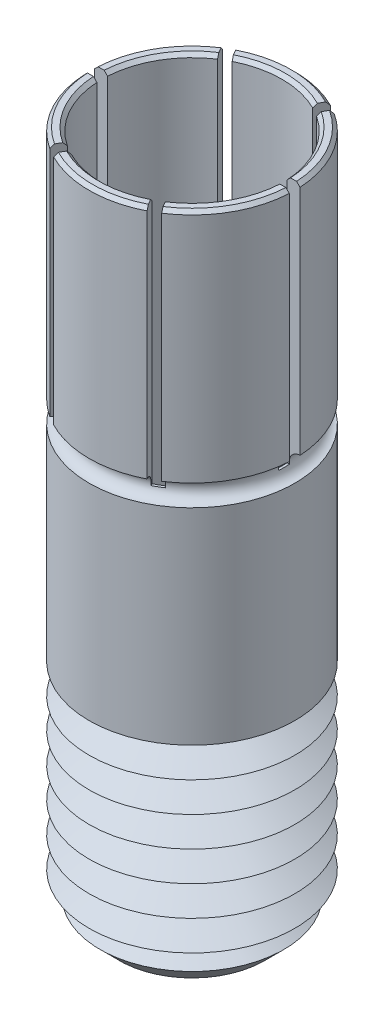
from build123d import *

# Parameters (mm, degrees)
CHAMFER1_SIZE       = 0.2
CUT_EXTRUDE1_DEPTH  = 14.5
CIRPATTERN1_COUNT   = 6
SKETCH8_R           = 6
BOSS_EXTRUDE1_DEPTH = 13
CHAMFER2_SIZE       = 1.75
LPATTERN1_COUNT     = 7
LPATTERN1_PITCH     = 1.75


with BuildPart() as part:
    # Sketch2 → Revolve1 (revolve)
    with BuildSketch(Plane(origin=(0, 0, 0), x_dir=(0, 0, -1), z_dir=(1, 0, 0))):
        with BuildLine():
            Line((-5.25, 1.825306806), (-5.25, -25.174693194))
            Line((-5.25, -25.174693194), (-6, -25.174693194))
            Line((-6, -25.174693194), (-6, -13.174693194))
            ThreePointArc((-6, -13.174693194), (-5.375, -12.549693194), (-6, -11.924693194))
            Line((-6, -11.924693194), (-6, 1.825306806))
            Line((-6, 1.825306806), (-5.25, 1.825306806))
        make_face()
    revolve(axis=Axis((0, 63.031918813, 0), (0, -1, 0)))

    # Chamfer1
    chamfer1_edges = [part.edges().sort_by_distance(p)[0] for p in [
        (0, 1.825306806, -5.25),
        (0, 1.825306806, -6),
    ]]
    chamfer(chamfer1_edges, length=CHAMFER1_SIZE)

    # Sketch5 → Cut-Extrude1 (cut)
    with BuildSketch(Plane(origin=(0, 1.825306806, 0), x_dir=(1, 0, 0), z_dir=(0, 1, 0))):
        with BuildLine():
            Line((-2.983679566, -0.3125), (-5.991856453, -0.3125))
            ThreePointArc((-5.991856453, -0.3125), (-6, 0), (-5.991856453, 0.3125))
            Line((-5.991856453, 0.3125), (-2.983679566, 0.3125))
            ThreePointArc((-2.983679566, 0.3125), (-3, 0), (-2.983679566, -0.3125))
        make_face()
    cut_extrude1 = extrude(amount=-CUT_EXTRUDE1_DEPTH, mode=Mode.SUBTRACT)

    # CirPattern1: Cut-Extrude1 ×6 about axis
    cirpattern1_axis = Axis((0, 0, 0), (0, 1, 0))
    for i in range(1, CIRPATTERN1_COUNT):
        add(cut_extrude1.rotate(cirpattern1_axis, i * 360 / CIRPATTERN1_COUNT), mode=Mode.SUBTRACT)

    # Sketch8 → Boss-Extrude1 (add)
    with BuildSketch(Plane.XZ.offset(25.174693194)):
        with Locations(Location((0, 0, 0), (0, 0, 90))):
            Circle(SKETCH8_R)
    extrude(amount=BOSS_EXTRUDE1_DEPTH)

    # Chamfer2
    chamfer2_edges = [part.edges().sort_by_distance(p)[0] for p in [
        (0, -38.174693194, -6),
    ]]
    chamfer(chamfer2_edges, length=CHAMFER2_SIZE)

    # Sketch10 → Cut-Revolve1 (revolve, cut)
    with BuildSketch(Plane(origin=(0, 0, 0), x_dir=(0, 0, -1), z_dir=(1, 0, 0)), mode=Mode.PRIVATE) as cut_revolve1_sk:
        Polygon((6, -25.174693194), (4.484455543, -26.049693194), (6, -26.924693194), align=None)
    cut_revolve1 = revolve(cut_revolve1_sk.sketch.rotate(Axis((0, 63.031918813, 0), (0, -1, 0)), 180), axis=Axis((0, 63.031918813, 0), (0, -1, 0)), mode=Mode.SUBTRACT)

    # LPattern1: Cut-Revolve1 ×7
    with Locations(*[(0, -i * LPATTERN1_PITCH, 0) for i in range(1, LPATTERN1_COUNT)]):
        add(cut_revolve1, mode=Mode.SUBTRACT)


solid = part.part
